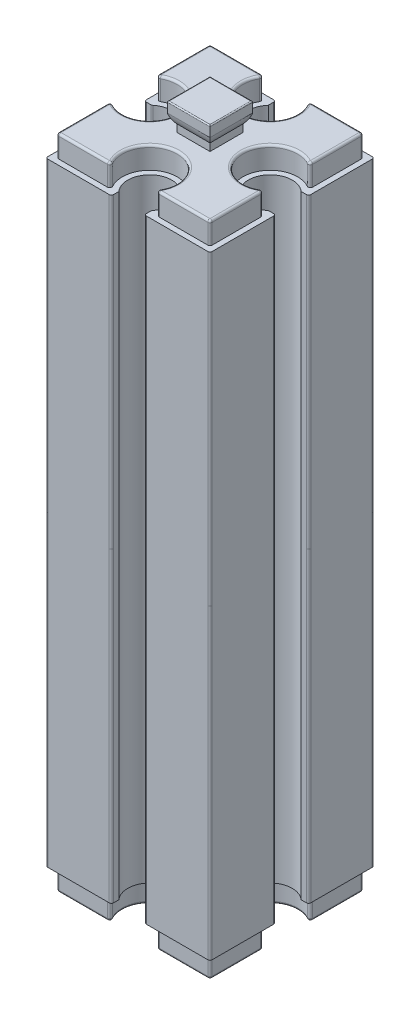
from build123d import *

# Parameters (mm, degrees)
EXTRUDE_1_DEPTH        = 28
EXTRUDE_2_DEPTH        = 2
EXTRUDE_3_DEPTH        = 2
FILLET_3_R             = 0.2
CUT_EXTRUDE_1_DEPTH    = 3
FILLET_4_R             = 0.2
FILLET_5_R             = 0.1
FILLET_3_OF_MIRROR_1_R = 0.2
FILLET_4_OF_MIRROR_1_R = 0.2
FILLET_5_OF_MIRROR_1_R = 0.1


with BuildPart() as part:
    # Sketch 1 → Extrude 1 (new body)
    with BuildSketch(Plane(origin=(0, 0, 0), x_dir=(1, 0, 0), z_dir=(0, 1, 0))):
        with BuildLine():
            Line((-7.5, 7.5), (-1.5, 7.5))
            Line((-1.5, 7.5), (-1.5, 6.822875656))
            ThreePointArc((-1.5, 6.822875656), (0, 3.5), (1.5, 6.822875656))
            Line((1.5, 6.822875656), (1.5, 7.5))
            Line((1.5, 7.5), (7.5, 7.5))
            Line((7.5, 7.5), (7.5, 1.5))
            Line((7.5, 1.5), (6.822875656, 1.5))
            ThreePointArc((6.822875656, 1.5), (3.5, 0), (6.822875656, -1.5))
            Line((6.822875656, -1.5), (7.5, -1.5))
            Line((7.5, -1.5), (7.5, -7.5))
            Line((7.5, -7.5), (1.5, -7.5))
            Line((1.5, -7.5), (1.5, -6.822875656))
            ThreePointArc((1.5, -6.822875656), (0, -3.5), (-1.5, -6.822875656))
            Line((-1.5, -6.822875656), (-1.5, -7.5))
            Line((-1.5, -7.5), (-7.5, -7.5))
            Line((-7.5, -7.5), (-7.5, -1.5))
            Line((-7.5, -1.5), (-6.822875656, -1.5))
            ThreePointArc((-6.822875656, -1.5), (-3.5, 0), (-6.822875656, 1.5))
            Line((-6.822875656, 1.5), (-7.5, 1.5))
            Line((-7.5, 1.5), (-7.5, 7.5))
        make_face()
    extrude_1 = extrude(amount=EXTRUDE_1_DEPTH)

    # Sketch 2 → Extrude 2 (add)
    with BuildSketch(Plane(origin=(0, 28, 0), x_dir=(1, 0, 0), z_dir=(0, 1, 0))):
        with BuildLine():
            Line((-7, 7), (-7, 2))
            ThreePointArc((-7, 2), (-3, 0), (-7, -2))
            Line((-7, -2), (-7, -7))
            Line((-7, -7), (-2, -7))
            ThreePointArc((-2, -7), (0, -3), (2, -7))
            Line((2, -7), (7, -7))
            Line((7, -7), (7, -2))
            ThreePointArc((7, -2), (3, 0), (7, 2))
            Line((7, 2), (7, 7))
            Line((7, 7), (2, 7))
            ThreePointArc((2, 7), (0, 3), (-2, 7))
            Line((-2, 7), (-7, 7))
        make_face()
    extrude_2 = extrude(amount=EXTRUDE_2_DEPTH)

    # Sketch 3 → Extrude 3 (add, symmetric)
    with BuildSketch(Plane(origin=(0, 0, 0), x_dir=(0, 0, -1), z_dir=(1, 0, 0))):
        with BuildLine():
            Line((-1.5, 30), (1.5, 30))
            Line((1.5, 30), (1.5, 30.677124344))
            ThreePointArc((1.5, 30.677124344), (1.780042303, 31.088161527), (1.95, 31.555590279))
            Line((1.95, 31.555590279), (1.95, 32.5))
            Line((1.95, 32.5), (-1.95, 32.5))
            Line((-1.95, 32.5), (-1.95, 31.555590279))
            ThreePointArc((-1.95, 31.555590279), (-1.780042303, 31.088161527), (-1.5, 30.677124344))
            Line((-1.5, 30.677124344), (-1.5, 30))
        make_face()
    extrude_3 = extrude(amount=EXTRUDE_3_DEPTH, both=True)

    # Fillet 3
    fillet_3_edges = [part.edges().sort_by_distance(p)[0] for p in [
        (-7.5, 14, -7.5),
        (-1.5, 14, -7.5),
        (1.5, 14, -7.5),
        (7.5, 14, -7.5),
        (7.5, 14, -1.5),
        (7.5, 14, 1.5),
        (7.5, 14, 7.5),
        (1.5, 14, 7.5),
        (-1.5, 14, 7.5),
        (-7.5, 14, 7.5),
        (-7.5, 14, 1.5),
        (-6.822875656, 14, -1.5),
        (-7.5, 14, -1.5),
    ]]
    fillet(fillet_3_edges, radius=FILLET_3_R)

    # Sketch 4 → Cut-Extrude 1 (cut, symmetric)
    with BuildSketch(Plane.XY):
        with BuildLine():
            Line((1.95, 32.5), (2, 32.5))
            Line((2, 32.5), (2, 30))
            Line((2, 30), (1.5, 30))
            Line((1.5, 30), (1.5, 30.677124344))
            ThreePointArc((1.5, 30.677124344), (1.780042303, 31.088161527), (1.95, 31.555590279))
            Line((1.95, 31.555590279), (1.95, 32.5))
        make_face()
        with BuildLine():
            Line((-1.95, 32.5), (-1.95, 31.555590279))
            ThreePointArc((-1.95, 31.555590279), (-1.780042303, 31.088161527), (-1.5, 30.677124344))
            Line((-1.5, 30.677124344), (-1.5, 30))
            Line((-1.5, 30), (-2, 30))
            Line((-2, 30), (-2, 32.5))
            Line((-2, 32.5), (-1.95, 32.5))
        make_face()
    cut_extrude_1 = extrude(amount=CUT_EXTRUDE_1_DEPTH, both=True, mode=Mode.SUBTRACT)

    # Fillet 4
    fillet_4_edges = [part.edges().sort_by_distance(p)[0] for p in [
        (-2, 29, -7),
        (-7, 29, -7),
        (-7, 29, -2),
        (-7, 29, 2),
        (-7, 29, 7),
        (-2, 29, 7),
        (2, 29, 7),
        (7, 29, 7),
        (7, 29, 2),
        (7, 29, -2),
        (7, 29, -7),
        (2, 29, -7),
        (-4.5, 30, -7),
        (-7, 30, -4.5),
        (-3, 30, 0),
        (-7, 30, 4.5),
        (-4.5, 30, 7),
        (0, 30, 3),
        (4.5, 30, 7),
        (7, 30, 4.5),
        (3, 30, 0),
        (7, 30, -4.5),
        (4.5, 30, -7),
        (0, 30, -3),
    ]]
    fillet(fillet_4_edges, radius=FILLET_4_R)

    # Fillet 5
    fillet_5_edges = [part.edges().sort_by_distance(p)[0] for p in [
        (1.95, 32.5, 0),
        (0, 32.5, -1.95),
        (0, 32.5, 1.95),
        (-1.95, 32.5, 0),
    ]]
    fillet(fillet_5_edges, radius=FILLET_5_R)


with BuildPart() as mirror_1_1:
    # Mirror 1: Extrude 1, Extrude 2, Extrude 3 across Top Plane
    add(extrude_1.mirror(Plane(origin=(0, 0, 0), x_dir=(1, 0, 0), z_dir=(0, 1, 0))))
    add(extrude_2.mirror(Plane(origin=(0, 0, 0), x_dir=(1, 0, 0), z_dir=(0, 1, 0))))
    add(extrude_3.mirror(Plane(origin=(0, 0, 0), x_dir=(1, 0, 0), z_dir=(0, 1, 0))))

    # Mirror 1 2: Cut-Extrude 1 across Top Plane
    add(cut_extrude_1.mirror(Plane(origin=(0, 0, 0), x_dir=(1, 0, 0), z_dir=(0, 1, 0))), mode=Mode.SUBTRACT)

    # Fillet 3 of Mirror 1
    fillet_3_of_mirror_1_edges = [mirror_1_1.edges().sort_by_distance(p)[0] for p in [
        (-7.5, -14, -7.5),
        (-1.5, -14, -7.5),
        (1.5, -14, -7.5),
        (7.5, -14, -7.5),
        (7.5, -14, -1.5),
        (7.5, -14, 1.5),
        (7.5, -14, 7.5),
        (1.5, -14, 7.5),
        (-1.5, -14, 7.5),
        (-7.5, -14, 7.5),
        (-7.5, -14, 1.5),
        (-6.822875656, -14, -1.5),
        (-7.5, -14, -1.5),
    ]]
    fillet(fillet_3_of_mirror_1_edges, radius=FILLET_3_OF_MIRROR_1_R)

    # Fillet 4 of Mirror 1
    fillet_4_of_mirror_1_edges = [mirror_1_1.edges().sort_by_distance(p)[0] for p in [
        (-2, -29, -7),
        (-7, -29, -7),
        (-7, -29, -2),
        (-7, -29, 2),
        (-7, -29, 7),
        (-2, -29, 7),
        (2, -29, 7),
        (7, -29, 7),
        (7, -29, 2),
        (7, -29, -2),
        (7, -29, -7),
        (2, -29, -7),
        (-4.5, -30, -7),
        (-7, -30, -4.5),
        (-3, -30, 0),
        (-7, -30, 4.5),
        (-4.5, -30, 7),
        (0, -30, 3),
        (4.5, -30, 7),
        (7, -30, 4.5),
        (3, -30, 0),
        (7, -30, -4.5),
        (4.5, -30, -7),
        (0, -30, -3),
    ]]
    fillet(fillet_4_of_mirror_1_edges, radius=FILLET_4_OF_MIRROR_1_R)

    # Fillet 5 of Mirror 1
    fillet_5_of_mirror_1_edges = [mirror_1_1.edges().sort_by_distance(p)[0] for p in [
        (1.95, -32.5, 0),
        (0, -32.5, -1.95),
        (0, -32.5, 1.95),
        (-1.95, -32.5, 0),
    ]]
    fillet(fillet_5_of_mirror_1_edges, radius=FILLET_5_OF_MIRROR_1_R)


with BuildPart() as part_1:
    add(part.part)

    # Mirror 1 united with what the copies tou: union Mirror 1_1
    add(mirror_1_1.part)


solid = part_1.part
